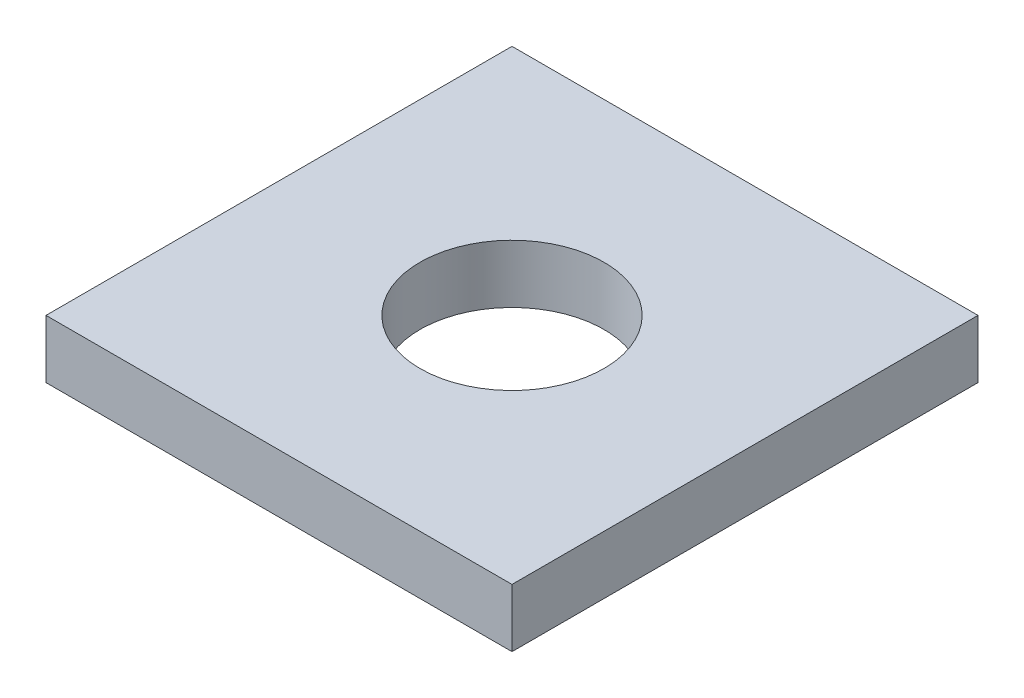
from build123d import *

# Parameters (mm, degrees)
SKETCH1_W      = 50.8
SKETCH1_H      = 50.8
SKETCH1_R      = 10.033
EXTRUDE1_DEPTH = 6.35


with BuildPart() as part:
    # Sketch1 → Extrude1 (new body)
    with BuildSketch(Plane(origin=(0, 0, 0), x_dir=(1, 0, 0), z_dir=(0, 1, 0))):
        Rectangle(SKETCH1_W, SKETCH1_H)
        with Locations(Location((0, 0, 0), (0, 0, 270))):
            Circle(SKETCH1_R, mode=Mode.SUBTRACT)
    extrude(amount=EXTRUDE1_DEPTH)


solid = part.part
